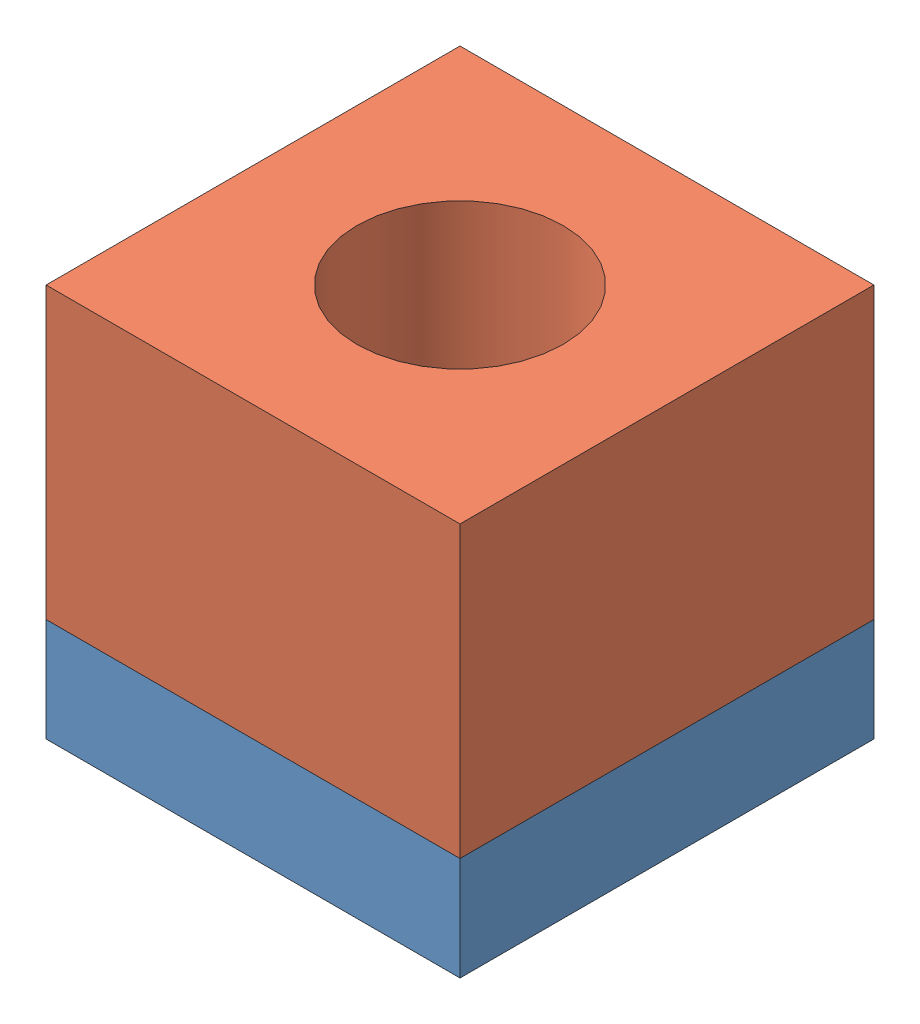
SolidWorks assembly 盒子.SLDASM, configuration 默认 (file format 10000). Lengths in mm.
Overall size (200 190 200).
2 component instances, 2 part files, 4 mates.
Components (placement in the parent):
- 盒子1-1: 盒子1.SLDPRT [默认] at (-0.3913 57.1893 164.3855) size (200 50 200)
- 盒子2-1: 盒子2.SLDPRT [默认] at (-28.2469 107.1893 153.1874) size (200 140 200)
Mates (geometry in assembly coordinates):
- 重合1: coincident anti-aligned: plane of 盒子1-1 through (-0.3913 107.1893 164.3855) normal (0 1 0); plane of 盒子2-1 through (-28.2469 107.1893 153.1874) normal (0 -1 0)
- 重合2: coincident aligned: line of 盒子1-1 through (67.4053 107.1893 270.0352) axis (0 -1 0); line of 盒子2-1 through (67.4053 247.1893 270.0352) axis (0 -1 0)
- 重合3: coincident aligned: line of 盒子1-1 through (-132.5947 107.1893 270.0352) axis (0 -1 0); line of 盒子2-1 through (-132.5947 247.1893 270.0352) axis (0 -1 0)
- 平行1: parallel: plane of 盒子1-1 through (-132.5947 107.1893 70.0352) normal (0 0 -1); line of 盒子2-1 through (-132.5947 247.1893 70.0352) axis (0 -1 0)
